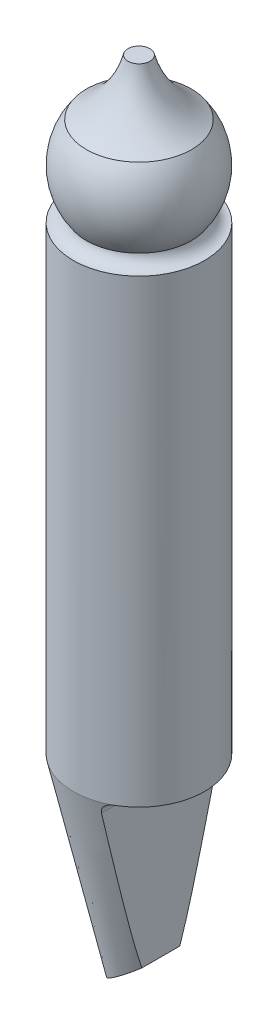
ISO-10303-21;
HEADER;
FILE_DESCRIPTION(('STEP AP214'),'2;1');
FILE_NAME('part.step','',(''),(''),'','','');
FILE_SCHEMA(('AUTOMOTIVE_DESIGN { 1 0 10303 214 1 1 1 1 }'));
ENDSEC;
DATA;
#1=APPLICATION_CONTEXT('core data for automotive mechanical design processes');
#2=APPLICATION_PROTOCOL_DEFINITION('international standard','automotive_design',2000,#1);
#3=PRODUCT_CONTEXT('',#1,'mechanical');
#4=PRODUCT('Part','Part','',(#3));
#5=PRODUCT_RELATED_PRODUCT_CATEGORY('part','',(#4));
#6=PRODUCT_DEFINITION_FORMATION('','',#4);
#7=PRODUCT_DEFINITION_CONTEXT('part definition',#1,'design');
#8=PRODUCT_DEFINITION('design','',#6,#7);
#9=PRODUCT_DEFINITION_SHAPE('','',#8);
#10=(LENGTH_UNIT() NAMED_UNIT(*) SI_UNIT(.MILLI.,.METRE.));
#11=(NAMED_UNIT(*) PLANE_ANGLE_UNIT() SI_UNIT($,.RADIAN.));
#12=(NAMED_UNIT(*) SI_UNIT($,.STERADIAN.) SOLID_ANGLE_UNIT());
#13=UNCERTAINTY_MEASURE_WITH_UNIT(LENGTH_MEASURE(1.E-05),#10,'distance_accuracy_value','');
#14=(GEOMETRIC_REPRESENTATION_CONTEXT(3) GLOBAL_UNCERTAINTY_ASSIGNED_CONTEXT((#13)) GLOBAL_UNIT_ASSIGNED_CONTEXT((#10,
#11,#12)) REPRESENTATION_CONTEXT('',''));
#15=CARTESIAN_POINT('',(0.,0.,0.));
#16=DIRECTION('',(0.,0.,1.));
#17=DIRECTION('',(1.,0.,0.));
#18=AXIS2_PLACEMENT_3D('',#15,#16,#17);
#19=CARTESIAN_POINT('',(0.,9.,0.));
#20=DIRECTION('',(0.,1.,0.));
#21=DIRECTION('',(0.,0.,1.));
#22=AXIS2_PLACEMENT_3D('',#19,#20,#21);
#23=CONICAL_SURFACE('',#22,3.,0.218668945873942);
#24=CARTESIAN_POINT('',(0.,9.,0.));
#25=DIRECTION('',(0.,1.,0.));
#26=DIRECTION('',(0.,0.,1.));
#27=AXIS2_PLACEMENT_3D('',#24,#25,#26);
#28=CIRCLE('',#27,3.);
#29=CARTESIAN_POINT('',(1.50000000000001,9.,-2.59807621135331));
#30=VERTEX_POINT('',#29);
#31=CARTESIAN_POINT('',(1.50000000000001,9.,2.59807621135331));
#32=VERTEX_POINT('',#31);
#33=EDGE_CURVE('E54',#30,#32,#28,.T.);
#34=ORIENTED_EDGE('',*,*,#33,.F.);
#35=CARTESIAN_POINT('',(1.50000000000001,9.,-2.59807621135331));
#36=CARTESIAN_POINT('',(1.47417884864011,9.00002056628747,-2.6130093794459));
#37=CARTESIAN_POINT('',(1.44782787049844,8.99799764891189,-2.62717081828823));
#38=CARTESIAN_POINT('',(1.39471051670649,8.98952744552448,-2.65361666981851));
#39=CARTESIAN_POINT('',(1.36794260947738,8.98305420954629,-2.66588955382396));
#40=CARTESIAN_POINT('',(1.31482468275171,8.96529352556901,-2.68809514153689));
#41=CARTESIAN_POINT('',(1.28847745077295,8.95398196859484,-2.6980157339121));
#42=CARTESIAN_POINT('',(1.23751922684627,8.92654109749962,-2.71506477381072));
#43=CARTESIAN_POINT('',(1.21290336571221,8.91042602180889,-2.72220133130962));
#44=CARTESIAN_POINT('',(1.1691130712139,8.87577185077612,-2.73289924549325));
#45=CARTESIAN_POINT('',(1.14963799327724,8.85770748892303,-2.736771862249));
#46=CARTESIAN_POINT('',(1.11366355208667,8.8185139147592,-2.74220919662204));
#47=CARTESIAN_POINT('',(1.09716451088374,8.79738437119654,-2.74377366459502));
#48=CARTESIAN_POINT('',(1.0686922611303,8.75416608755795,-2.7446806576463));
#49=CARTESIAN_POINT('',(1.05649668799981,8.73222572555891,-2.74415922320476));
#50=CARTESIAN_POINT('',(1.03555351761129,8.68685323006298,-2.74135518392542));
#51=CARTESIAN_POINT('',(1.02680730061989,8.66342050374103,-2.73907187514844));
#52=CARTESIAN_POINT('',(1.01322911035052,8.61670629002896,-2.7330557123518));
#53=CARTESIAN_POINT('',(1.0082499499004,8.59345877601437,-2.72938684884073));
#54=CARTESIAN_POINT('',(1.00162924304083,8.54675811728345,-2.7207632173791));
#55=CARTESIAN_POINT('',(0.999983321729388,8.52330528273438,-2.71581014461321));
#56=CARTESIAN_POINT('',(1.00000000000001,8.5,-2.71029131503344));
#57=B_SPLINE_CURVE_WITH_KNOTS('',3,(#35,#36,#37,#38,#39,#40,#41,#42,#43,#44,#45,#46,#47,#48,#49,
#50,#51,#52,#53,#54,#55,#56),.UNSPECIFIED.,.F.,.F.,(4,2,2,2,2,2,2,2,2,2,4),(0.,
0.089512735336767,0.179551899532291,0.270045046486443,0.360272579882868,0.440378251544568,
0.520492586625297,0.595469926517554,0.670477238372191,0.742376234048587,0.814180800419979),.UNSPECIFIED.);
#58=CARTESIAN_POINT('',(1.00000000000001,8.49999999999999,-2.71029131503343));
#59=VERTEX_POINT('',#58);
#60=EDGE_CURVE('E11',#30,#59,#57,.T.);
#61=ORIENTED_EDGE('',*,*,#60,.T.);
#62=CARTESIAN_POINT('',(1.00000000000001,14.7850191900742,-4.16725604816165));
#63=CARTESIAN_POINT('',(1.00000000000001,14.2111747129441,-4.03609342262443));
#64=CARTESIAN_POINT('',(1.00000000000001,13.6373942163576,-3.90464883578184));
#65=CARTESIAN_POINT('',(1.00000000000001,12.4899407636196,-3.64086626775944));
#66=CARTESIAN_POINT('',(1.00000000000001,11.916267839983,-3.50852814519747));
#67=CARTESIAN_POINT('',(1.00000000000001,10.7726072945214,-3.24346217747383));
#68=CARTESIAN_POINT('',(1.00000000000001,10.2026180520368,-3.11074133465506));
#69=CARTESIAN_POINT('',(1.00000000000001,9.06312541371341,-2.84362112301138));
#70=CARTESIAN_POINT('',(1.00000000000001,8.49362195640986,-2.70922201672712));
#71=CARTESIAN_POINT('',(1.00000000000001,7.41188298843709,-2.45133384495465));
#72=CARTESIAN_POINT('',(1.,6.89958918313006,-2.32809027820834));
#73=CARTESIAN_POINT('',(1.,6.1316494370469,-2.140673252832));
#74=CARTESIAN_POINT('',(1.,5.8756959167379,-2.07776129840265));
#75=CARTESIAN_POINT('',(1.,5.36406832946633,-1.95082823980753));
#76=CARTESIAN_POINT('',(1.,5.10839425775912,-1.88680715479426));
#77=CARTESIAN_POINT('',(1.,4.59575797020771,-1.75686018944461));
#78=CARTESIAN_POINT('',(1.,4.33879820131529,-1.69092462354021));
#79=CARTESIAN_POINT('',(1.,3.8254096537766,-1.55694291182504));
#80=CARTESIAN_POINT('',(1.,3.56898091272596,-1.48889662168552));
#81=CARTESIAN_POINT('',(1.,3.05724705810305,-1.34980417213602));
#82=CARTESIAN_POINT('',(1.,2.80194098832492,-1.27876157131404));
#83=CARTESIAN_POINT('',(1.,2.42007033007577,-1.1684813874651));
#84=CARTESIAN_POINT('',(1.,2.29296946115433,-1.13110440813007));
#85=CARTESIAN_POINT('',(1.,2.03926709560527,-1.05469184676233));
#86=CARTESIAN_POINT('',(1.,1.91266558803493,-1.01565630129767));
#87=CARTESIAN_POINT('',(1.,1.66067231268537,-0.93546020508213));
#88=CARTESIAN_POINT('',(1.,1.53527776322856,-0.894308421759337));
#89=CARTESIAN_POINT('',(1.,1.28532519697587,-0.808654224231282));
#90=CARTESIAN_POINT('',(1.,1.16076944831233,-0.764145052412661));
#91=CARTESIAN_POINT('',(1.,0.975858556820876,-0.693611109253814));
#92=CARTESIAN_POINT('',(1.,0.914752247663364,-0.669561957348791));
#93=CARTESIAN_POINT('',(1.,0.793251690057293,-0.619735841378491));
#94=CARTESIAN_POINT('',(0.999999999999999,0.732857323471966,-0.593959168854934));
#95=CARTESIAN_POINT('',(0.999999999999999,0.613318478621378,-0.540100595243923));
#96=CARTESIAN_POINT('',(0.999999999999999,0.554170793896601,-0.512025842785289));
#97=CARTESIAN_POINT('',(0.999999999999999,0.437647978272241,-0.452440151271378));
#98=CARTESIAN_POINT('',(0.999999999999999,0.380270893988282,-0.420933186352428));
#99=CARTESIAN_POINT('',(0.999999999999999,0.306565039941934,-0.375495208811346));
#100=CARTESIAN_POINT('',(0.999999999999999,0.288700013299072,-0.364075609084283));
#101=CARTESIAN_POINT('',(0.999999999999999,0.253456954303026,-0.34050410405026));
#102=CARTESIAN_POINT('',(0.999999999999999,0.236079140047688,-0.328351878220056));
#103=CARTESIAN_POINT('',(0.999999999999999,0.184977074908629,-0.290663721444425));
#104=CARTESIAN_POINT('',(0.999999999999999,0.152145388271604,-0.263814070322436));
#105=CARTESIAN_POINT('',(0.999999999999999,0.10800731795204,-0.220790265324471));
#106=CARTESIAN_POINT('',(0.999999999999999,0.0946741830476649,-0.206711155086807));
#107=CARTESIAN_POINT('',(0.999999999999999,0.0695986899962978,-0.177154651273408));
#108=CARTESIAN_POINT('',(0.999999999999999,0.0578568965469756,-0.161676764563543));
#109=CARTESIAN_POINT('',(0.999999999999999,0.0385278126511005,-0.131821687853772));
#110=CARTESIAN_POINT('',(0.999999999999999,0.0305745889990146,-0.117685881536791));
#111=CARTESIAN_POINT('',(0.999999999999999,0.0170430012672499,-0.0883207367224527));
#112=CARTESIAN_POINT('',(0.999999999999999,0.0114585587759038,-0.073094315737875));
#113=CARTESIAN_POINT('',(0.999999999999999,0.00421374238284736,-0.0450297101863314));
#114=CARTESIAN_POINT('',(0.999999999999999,0.0019841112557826,-0.0323406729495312));
#115=CARTESIAN_POINT('',(0.999999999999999,-0.000263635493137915,-0.00676761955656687));
#116=CARTESIAN_POINT('',(0.999999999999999,-0.000283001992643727,0.00611628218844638));
#117=CARTESIAN_POINT('',(0.999999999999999,0.0018891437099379,0.0316700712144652));
#118=CARTESIAN_POINT('',(0.999999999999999,0.00407722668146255,0.0443402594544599));
#119=CARTESIAN_POINT('',(0.999999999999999,0.0104087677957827,0.0691797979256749));
#120=CARTESIAN_POINT('',(0.999999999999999,0.0145542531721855,0.0813486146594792));
#121=CARTESIAN_POINT('',(0.999999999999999,0.0270637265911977,0.111314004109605));
#122=CARTESIAN_POINT('',(0.999999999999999,0.0364986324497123,0.128658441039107));
#123=CARTESIAN_POINT('',(0.999999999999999,0.0578693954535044,0.161724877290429));
#124=CARTESIAN_POINT('',(0.999999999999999,0.0698128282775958,0.177441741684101));
#125=CARTESIAN_POINT('',(0.999999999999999,0.0985957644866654,0.211288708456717));
#126=CARTESIAN_POINT('',(0.999999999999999,0.115906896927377,0.229011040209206));
#127=CARTESIAN_POINT('',(0.999999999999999,0.152146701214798,0.262739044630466));
#128=CARTESIAN_POINT('',(0.999999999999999,0.17107849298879,0.278741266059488));
#129=CARTESIAN_POINT('',(0.999999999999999,0.210107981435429,0.309483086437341));
#130=CARTESIAN_POINT('',(0.999999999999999,0.230211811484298,0.324214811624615));
#131=CARTESIAN_POINT('',(0.999999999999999,0.271139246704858,0.352584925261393));
#132=CARTESIAN_POINT('',(0.999999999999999,0.291962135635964,0.366224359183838));
#133=CARTESIAN_POINT('',(0.999999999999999,0.356197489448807,0.40647281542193));
#134=CARTESIAN_POINT('',(0.999999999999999,0.400456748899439,0.431725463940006));
#135=CARTESIAN_POINT('',(0.999999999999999,0.490269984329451,0.479832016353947));
#136=CARTESIAN_POINT('',(0.999999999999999,0.535824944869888,0.502684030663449));
#137=CARTESIAN_POINT('',(0.999999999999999,0.673925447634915,0.568768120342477));
#138=CARTESIAN_POINT('',(0.999999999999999,0.767702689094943,0.609411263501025));
#139=CARTESIAN_POINT('',(1.,0.957005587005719,0.686724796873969));
#140=CARTESIAN_POINT('',(1.,1.0525339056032,0.723388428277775));
#141=CARTESIAN_POINT('',(1.,1.24443780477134,0.793944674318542));
#142=CARTESIAN_POINT('',(1.,1.3408118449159,0.827841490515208));
#143=CARTESIAN_POINT('',(1.,1.53311700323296,0.893343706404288));
#144=CARTESIAN_POINT('',(1.,1.6290408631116,0.924970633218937));
#145=CARTESIAN_POINT('',(1.,1.82134376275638,0.986813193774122));
#146=CARTESIAN_POINT('',(1.,1.91772281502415,1.01702878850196));
#147=CARTESIAN_POINT('',(1.,2.20738405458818,1.10606267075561));
#148=CARTESIAN_POINT('',(1.,2.40116355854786,1.16325916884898));
#149=CARTESIAN_POINT('',(1.,2.78971538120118,1.27492518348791));
#150=CARTESIAN_POINT('',(1.,2.98448852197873,1.32939180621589));
#151=CARTESIAN_POINT('',(1.,3.37455535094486,1.43636198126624));
#152=CARTESIAN_POINT('',(1.,3.56984899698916,1.48886568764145));
#153=CARTESIAN_POINT('',(1.,3.96022624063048,1.59228679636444));
#154=CARTESIAN_POINT('',(1.,4.15530870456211,1.64320849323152));
#155=CARTESIAN_POINT('',(1.,4.5457565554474,1.74396929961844));
#156=CARTESIAN_POINT('',(1.,4.74112194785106,1.7938083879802));
#157=CARTESIAN_POINT('',(1.,5.3273520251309,1.94202599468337));
#158=CARTESIAN_POINT('',(1.,5.71853294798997,2.03915261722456));
#159=CARTESIAN_POINT('',(1.,6.47008309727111,2.22356389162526));
#160=CARTESIAN_POINT('',(1.00000000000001,6.83041194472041,2.31101397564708));
#161=CARTESIAN_POINT('',(1.00000000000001,7.55138646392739,2.48460386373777));
#162=CARTESIAN_POINT('',(1.00000000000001,7.91203213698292,2.57074366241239));
#163=CARTESIAN_POINT('',(1.00000000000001,8.99444649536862,2.82776924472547));
#164=CARTESIAN_POINT('',(1.00000000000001,9.71655374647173,2.99722748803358));
#165=CARTESIAN_POINT('',(1.00000000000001,11.1629440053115,3.33429031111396));
#166=CARTESIAN_POINT('',(1.00000000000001,11.8872282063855,3.50188975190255));
#167=CARTESIAN_POINT('',(1.00000000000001,12.9738298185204,3.75216390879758));
#168=CARTESIAN_POINT('',(1.00000000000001,13.3360198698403,3.83539206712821));
#169=CARTESIAN_POINT('',(1.00000000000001,14.0604702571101,4.00154010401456));
#170=CARTESIAN_POINT('',(1.00000000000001,14.422730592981,4.08445998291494));
#171=CARTESIAN_POINT('',(1.00000000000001,14.7850191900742,4.16725604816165));
#172=B_SPLINE_CURVE_WITH_KNOTS('',3,(#62,#63,#64,#65,#66,#67,#68,#69,#70,#71,#72,#73,#74,#75,
#76,#77,#78,#79,#80,#81,#82,#83,#84,#85,#86,#87,#88,#89,#90,#91,#92,#93,#94,#95,#96,#97,#98,#99,
#100,#101,#102,#103,#104,#105,#106,#107,#108,#109,#110,#111,#112,#113,#114,#115,#116,#117,#118,
#119,#120,#121,#122,#123,#124,#125,#126,#127,#128,#129,#130,#131,#132,#133,#134,#135,#136,#137,
#138,#139,#140,#141,#142,#143,#144,#145,#146,#147,#148,#149,#150,#151,#152,#153,#154,#155,#156,
#157,#158,#159,#160,#161,#162,#163,#164,#165,#166,#167,#168,#169,#170,#171),.UNSPECIFIED.,.F.,
.F.,(4,2,2,2,2,2,2,2,2,2,2,2,2,2,2,2,2,2,2,2,2,2,2,2,2,2,2,2,2,2,2,2,2,2,2,2,2,2,2,2,2,2,2,2,2,
2,2,2,2,2,2,2,2,2,4),(0.,1.76593097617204,3.53214824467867,5.28785796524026,7.04329638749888,
8.62401736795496,9.41473107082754,10.2054311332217,11.001277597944,11.7971786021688,
12.5921595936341,12.9896002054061,13.3870320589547,13.7829325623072,14.1796523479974,
14.3766403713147,14.5735952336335,14.7699591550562,14.9660980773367,15.0296876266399,
15.0933052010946,15.2200571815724,15.2781529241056,15.3362692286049,15.384772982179,
15.4331515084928,15.4716269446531,15.5100806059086,15.5484746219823,15.5869084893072,
15.645799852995,15.7048716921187,15.7790190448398,15.8533124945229,15.9280374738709,
16.0026900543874,16.1554265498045,16.3082823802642,16.6146972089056,16.9216245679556,
17.2280768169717,17.5310737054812,17.8340789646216,18.4401740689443,19.0468986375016,
19.6535754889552,20.2584284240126,20.8632931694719,22.0724572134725,23.1848213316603,
24.297190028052,26.5223558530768,28.7526219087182,29.8675105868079,30.9823980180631),.UNSPECIFIED.);
#173=CARTESIAN_POINT('',(1.,1.45308505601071,-0.866074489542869));
#174=VERTEX_POINT('',#173);
#175=EDGE_CURVE('E70',#59,#174,#172,.T.);
#176=ORIENTED_EDGE('',*,*,#175,.T.);
#177=CARTESIAN_POINT('',(0.192540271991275,0.866431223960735,0.));
#178=DIRECTION('',(0.587785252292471,-0.809016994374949,0.));
#179=DIRECTION('',(0.809016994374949,0.587785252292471,0.));
#180=AXIS2_PLACEMENT_3D('',#177,#178,#179);
#181=ELLIPSE('',#180,1.4740608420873,1.17689444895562);
#182=CARTESIAN_POINT('',(1.,1.45308505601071,0.866074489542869));
#183=VERTEX_POINT('',#182);
#184=EDGE_CURVE('E73',#174,#183,#181,.F.);
#185=ORIENTED_EDGE('',*,*,#184,.T.);
#186=CARTESIAN_POINT('',(1.00000000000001,8.49999999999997,2.71029131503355));
#187=VERTEX_POINT('',#186);
#188=EDGE_CURVE('E80',#183,#187,#172,.T.);
#189=ORIENTED_EDGE('',*,*,#188,.T.);
#190=CARTESIAN_POINT('',(1.00000000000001,8.5,2.71029131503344));
#191=CARTESIAN_POINT('',(0.999973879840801,8.52566932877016,2.71636996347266));
#192=CARTESIAN_POINT('',(1.00197619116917,8.5515228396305,2.721763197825));
#193=CARTESIAN_POINT('',(1.01002228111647,8.60292119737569,2.73097494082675));
#194=CARTESIAN_POINT('',(1.01607274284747,8.62846546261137,2.73479082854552));
#195=CARTESIAN_POINT('',(1.03221668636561,8.67853127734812,2.74062860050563));
#196=CARTESIAN_POINT('',(1.0423186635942,8.7030505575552,2.74264668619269));
#197=CARTESIAN_POINT('',(1.06630896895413,8.75022122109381,2.74465763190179));
#198=CARTESIAN_POINT('',(1.0801927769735,8.77287479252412,2.74465289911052));
#199=CARTESIAN_POINT('',(1.11071414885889,8.8148065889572,2.74249630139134));
#200=CARTESIAN_POINT('',(1.12722546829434,8.83418103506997,2.7404269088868));
#201=CARTESIAN_POINT('',(1.16279493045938,8.87004120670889,2.73418596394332));
#202=CARTESIAN_POINT('',(1.18185342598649,8.88652653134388,2.73001412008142));
#203=CARTESIAN_POINT('',(1.22151686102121,8.91599022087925,2.71967534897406));
#204=CARTESIAN_POINT('',(1.24209158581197,8.92902129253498,2.71354199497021));
#205=CARTESIAN_POINT('',(1.2843880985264,8.95176160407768,2.69937681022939));
#206=CARTESIAN_POINT('',(1.30611026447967,8.96146974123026,2.6913443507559));
#207=CARTESIAN_POINT('',(1.35136780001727,8.97804112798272,2.67304644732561));
#208=CARTESIAN_POINT('',(1.37493445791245,8.98470233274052,2.66267708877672));
#209=CARTESIAN_POINT('',(1.42199711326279,8.994462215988,2.64030641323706));
#210=CARTESIAN_POINT('',(1.44549314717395,8.9975632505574,2.62830618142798));
#211=CARTESIAN_POINT('',(1.47920532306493,8.99967849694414,2.60991741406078));
#212=CARTESIAN_POINT('',(1.48964260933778,9.00000105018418,2.60405755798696));
#213=CARTESIAN_POINT('',(1.50000000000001,9.,2.59807621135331));
#214=B_SPLINE_CURVE_WITH_KNOTS('',3,(#190,#191,#192,#193,#194,#195,#196,#197,#198,#199,#200,
#201,#202,#203,#204,#205,#206,#207,#208,#209,#210,#211,#212,#213),.UNSPECIFIED.,.F.,.F.,(4,2,2,
2,2,2,2,2,2,2,2,4),(0.,0.0790840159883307,0.158298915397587,0.237680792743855,0.316968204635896,
0.393210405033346,0.469463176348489,0.544474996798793,0.619511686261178,0.698983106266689,
0.778401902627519,0.814297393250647),.UNSPECIFIED.);
#215=EDGE_CURVE('E49',#187,#32,#214,.T.);
#216=ORIENTED_EDGE('',*,*,#215,.T.);
#217=EDGE_LOOP('',(#34,#61,#176,#185,#189,#216));
#218=FACE_BOUND('',#217,.T.);
#219=ADVANCED_FACE('F35',(#218),#23,.T.);
#220=CARTESIAN_POINT('',(0.,30.5998930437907,0.));
#221=DIRECTION('',(0.,1.,0.));
#222=DIRECTION('',(0.,0.,1.));
#223=AXIS2_PLACEMENT_3D('',#220,#221,#222);
#224=TOROIDAL_SURFACE('',#223,2.98867145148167,0.6);
#225=CARTESIAN_POINT('',(0.,30.,0.));
#226=DIRECTION('',(0.,1.,0.));
#227=DIRECTION('',(0.,0.,1.));
#228=AXIS2_PLACEMENT_3D('',#225,#226,#227);
#229=CIRCLE('',#228,3.);
#230=CARTESIAN_POINT('',(0.,30.,3.));
#231=VERTEX_POINT('',#230);
#232=EDGE_CURVE('E89',#231,#231,#229,.T.);
#233=ORIENTED_EDGE('',*,*,#232,.T.);
#234=EDGE_LOOP('',(#233));
#235=FACE_BOUND('',#234,.T.);
#236=CARTESIAN_POINT('',(0.,30.4838502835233,0.));
#237=DIRECTION('',(0.,1.,0.));
#238=DIRECTION('',(0.,0.,1.));
#239=AXIS2_PLACEMENT_3D('',#236,#237,#238);
#240=CIRCLE('',#239,2.4);
#241=CARTESIAN_POINT('',(2.4,30.4838502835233,0.));
#242=VERTEX_POINT('',#241);
#243=EDGE_CURVE('E86',#242,#242,#240,.T.);
#244=ORIENTED_EDGE('',*,*,#243,.F.);
#245=EDGE_LOOP('',(#244));
#246=FACE_BOUND('',#245,.T.);
#247=ADVANCED_FACE('F127',(#235,#246),#224,.F.);
#248=CARTESIAN_POINT('',(0.,32.2838502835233,0.));
#249=DIRECTION('',(0.,1.,0.));
#250=DIRECTION('',(1.,0.,0.));
#251=AXIS2_PLACEMENT_3D('',#248,#249,#250);
#252=SPHERICAL_SURFACE('',#251,3.);
#253=CARTESIAN_POINT('',(0.,34.0838502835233,0.));
#254=DIRECTION('',(0.,1.,0.));
#255=DIRECTION('',(0.,0.,1.));
#256=AXIS2_PLACEMENT_3D('',#253,#254,#255);
#257=CIRCLE('',#256,2.4);
#258=CARTESIAN_POINT('',(2.4,34.0838502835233,0.));
#259=VERTEX_POINT('',#258);
#260=EDGE_CURVE('E99',#259,#259,#257,.T.);
#261=CARTESIAN_POINT('',(2.4,34.0838502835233,0.));
#262=CARTESIAN_POINT('',(2.42413167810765,34.0516754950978,0.));
#263=CARTESIAN_POINT('',(2.44761557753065,34.0190149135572,0.));
#264=CARTESIAN_POINT('',(2.49325153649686,33.9527761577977,0.));
#265=CARTESIAN_POINT('',(2.51540359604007,33.9191979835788,0.));
#266=CARTESIAN_POINT('',(2.55833959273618,33.8511780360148,0.));
#267=CARTESIAN_POINT('',(2.57912352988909,33.8167362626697,0.));
#268=CARTESIAN_POINT('',(2.61928978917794,33.7470449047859,0.));
#269=CARTESIAN_POINT('',(2.63867211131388,33.7117953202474,0.));
#270=CARTESIAN_POINT('',(2.67600376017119,33.6405453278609,0.));
#271=CARTESIAN_POINT('',(2.69395308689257,33.6045449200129,0.));
#272=CARTESIAN_POINT('',(2.72838972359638,33.531851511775,0.));
#273=CARTESIAN_POINT('',(2.74487703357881,33.495158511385,0.));
#274=CARTESIAN_POINT('',(2.77636296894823,33.4211392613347,0.));
#275=CARTESIAN_POINT('',(2.79136159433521,33.3838130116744,0.));
#276=CARTESIAN_POINT('',(2.81984590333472,33.3085876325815,0.));
#277=CARTESIAN_POINT('',(2.83333158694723,33.2706885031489,0.));
#278=CARTESIAN_POINT('',(2.85876820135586,33.1943786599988,0.));
#279=CARTESIAN_POINT('',(2.87071913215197,33.1559679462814,0.));
#280=CARTESIAN_POINT('',(2.89306691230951,33.0786970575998,0.));
#281=CARTESIAN_POINT('',(2.90346376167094,33.0398368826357,0.));
#282=CARTESIAN_POINT('',(2.92268656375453,32.9617299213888,0.));
#283=CARTESIAN_POINT('',(2.93151251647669,32.9224831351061,0.));
#284=CARTESIAN_POINT('',(2.94757925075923,32.843666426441,0.));
#285=CARTESIAN_POINT('',(2.9548200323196,32.8040965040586,0.));
#286=CARTESIAN_POINT('',(2.96770471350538,32.7246975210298,0.));
#287=CARTESIAN_POINT('',(2.97334861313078,32.6848684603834,0.));
#288=CARTESIAN_POINT('',(2.98303040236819,32.6050156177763,0.));
#289=CARTESIAN_POINT('',(2.9870682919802,32.5649918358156,0.));
#290=CARTESIAN_POINT('',(2.99353153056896,32.4848142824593,0.));
#291=CARTESIAN_POINT('',(2.99595687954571,32.4446605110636,0.));
#292=CARTESIAN_POINT('',(2.99919111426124,32.364287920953,0.));
#293=CARTESIAN_POINT('',(3.,32.3240691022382,0.));
#294=CARTESIAN_POINT('',(3.,32.2436314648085,0.));
#295=CARTESIAN_POINT('',(2.99919111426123,32.2034126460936,0.));
#296=CARTESIAN_POINT('',(2.99595687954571,32.1230400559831,0.));
#297=CARTESIAN_POINT('',(2.99353153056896,32.0828862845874,0.));
#298=CARTESIAN_POINT('',(2.98706829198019,32.002708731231,0.));
#299=CARTESIAN_POINT('',(2.98303040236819,31.9626849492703,0.));
#300=CARTESIAN_POINT('',(2.97334861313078,31.8828321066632,0.));
#301=CARTESIAN_POINT('',(2.96770471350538,31.8430030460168,0.));
#302=CARTESIAN_POINT('',(2.9548200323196,31.763604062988,0.));
#303=CARTESIAN_POINT('',(2.94757925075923,31.7240341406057,0.));
#304=CARTESIAN_POINT('',(2.93151251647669,31.6452174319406,0.));
#305=CARTESIAN_POINT('',(2.92268656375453,31.6059706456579,0.));
#306=CARTESIAN_POINT('',(2.90346376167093,31.527863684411,0.));
#307=CARTESIAN_POINT('',(2.8930669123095,31.4890035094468,0.));
#308=CARTESIAN_POINT('',(2.87071913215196,31.4117326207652,0.));
#309=CARTESIAN_POINT('',(2.85876820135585,31.3733219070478,0.));
#310=CARTESIAN_POINT('',(2.83333158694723,31.2970120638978,0.));
#311=CARTESIAN_POINT('',(2.81984590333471,31.2591129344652,0.));
#312=CARTESIAN_POINT('',(2.79136159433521,31.1838875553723,0.));
#313=CARTESIAN_POINT('',(2.77636296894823,31.146561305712,0.));
#314=CARTESIAN_POINT('',(2.74487703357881,31.0725420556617,0.));
#315=CARTESIAN_POINT('',(2.72838972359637,31.0358490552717,0.));
#316=CARTESIAN_POINT('',(2.69395308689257,30.9631556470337,0.));
#317=CARTESIAN_POINT('',(2.67600376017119,30.9271552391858,0.));
#318=CARTESIAN_POINT('',(2.63867211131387,30.8559052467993,0.));
#319=CARTESIAN_POINT('',(2.61928978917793,30.8206556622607,0.));
#320=CARTESIAN_POINT('',(2.57912352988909,30.750964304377,0.));
#321=CARTESIAN_POINT('',(2.55833959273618,30.7165225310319,0.));
#322=CARTESIAN_POINT('',(2.51540359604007,30.6485025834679,0.));
#323=CARTESIAN_POINT('',(2.49325153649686,30.614924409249,0.));
#324=CARTESIAN_POINT('',(2.44761557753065,30.5486856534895,0.));
#325=CARTESIAN_POINT('',(2.42413167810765,30.5160250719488,0.));
#326=CARTESIAN_POINT('',(2.4,30.4838502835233,0.));
#327=B_SPLINE_CURVE_WITH_KNOTS('',3,(#261,#262,#263,#264,#265,#266,#267,#268,#269,#270,#271,
#272,#273,#274,#275,#276,#277,#278,#279,#280,#281,#282,#283,#284,#285,#286,#287,#288,#289,#290,
#291,#292,#293,#294,#295,#296,#297,#298,#299,#300,#301,#302,#303,#304,#305,#306,#307,#308,#309,
#310,#311,#312,#313,#314,#315,#316,#317,#318,#319,#320,#321,#322,#323,#324,#325,#326),
.UNSPECIFIED.,.F.,.F.,(4,2,2,2,2,2,2,2,2,2,2,2,2,2,2,2,2,2,2,2,2,2,2,2,2,2,2,2,2,2,2,2,4),(0.,
0.120648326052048,0.241296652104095,0.361944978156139,0.48259330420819,0.603241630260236,
0.723889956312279,0.844538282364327,0.965186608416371,1.08583493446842,1.20648326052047,
1.32713158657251,1.44777991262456,1.56842823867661,1.68907656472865,1.8097248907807,
1.93037321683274,2.05102154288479,2.17166986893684,2.29231819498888,2.41296652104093,
2.53361484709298,2.65426317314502,2.77491149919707,2.89555982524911,3.01620815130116,
3.13685647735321,3.25750480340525,3.3781531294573,3.49880145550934,3.61944978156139,
3.74009810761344,3.86074643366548),.UNSPECIFIED.);
#328=EDGE_CURVE('BSEAM131',#259,#242,#327,.T.);
#329=ORIENTED_EDGE('',*,*,#260,.F.);
#330=ORIENTED_EDGE('',*,*,#243,.T.);
#331=ORIENTED_EDGE('',*,*,#328,.T.);
#332=ORIENTED_EDGE('',*,*,#328,.F.);
#333=EDGE_LOOP('',(#329,#331,#330,#332));
#334=FACE_BOUND('',#333,.T.);
#335=ADVANCED_FACE('F131',(#334),#252,.T.);
#336=CARTESIAN_POINT('',(0.,37.5526362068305,0.));
#337=DIRECTION('',(0.,1.,0.));
#338=DIRECTION('',(0.,0.,1.));
#339=AXIS2_PLACEMENT_3D('',#336,#337,#338);
#340=TOROIDAL_SURFACE('',#339,4.3918645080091,4.);
#341=ORIENTED_EDGE('',*,*,#260,.T.);
#342=EDGE_LOOP('',(#341));
#343=FACE_BOUND('',#342,.T.);
#344=CARTESIAN_POINT('',(0.,36.628844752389,0.));
#345=DIRECTION('',(0.,1.,0.));
#346=DIRECTION('',(0.,0.,1.));
#347=AXIS2_PLACEMENT_3D('',#344,#345,#346);
#348=CIRCLE('',#347,0.5);
#349=CARTESIAN_POINT('',(0.,36.628844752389,0.5));
#350=VERTEX_POINT('',#349);
#351=EDGE_CURVE('E96',#350,#350,#348,.T.);
#352=ORIENTED_EDGE('',*,*,#351,.F.);
#353=EDGE_LOOP('',(#352));
#354=FACE_BOUND('',#353,.T.);
#355=ADVANCED_FACE('F123',(#343,#354),#340,.F.);
#356=CARTESIAN_POINT('',(0.,36.628844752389,0.));
#357=DIRECTION('',(0.,1.,0.));
#358=DIRECTION('',(0.,0.,1.));
#359=AXIS2_PLACEMENT_3D('',#356,#357,#358);
#360=PLANE('',#359);
#361=ORIENTED_EDGE('',*,*,#351,.T.);
#362=EDGE_LOOP('',(#361));
#363=FACE_BOUND('',#362,.T.);
#364=ADVANCED_FACE('F119',(#363),#360,.T.);
#365=CARTESIAN_POINT('',(0.,30.,0.));
#366=DIRECTION('',(0.,1.,0.));
#367=DIRECTION('',(0.,0.,1.));
#368=AXIS2_PLACEMENT_3D('',#365,#366,#367);
#369=CYLINDRICAL_SURFACE('',#368,3.);
#370=ORIENTED_EDGE('',*,*,#33,.T.);
#371=EDGE_CURVE('E94',#32,#30,#28,.T.);
#372=ORIENTED_EDGE('',*,*,#371,.T.);
#373=EDGE_LOOP('',(#370,#372));
#374=FACE_BOUND('',#373,.T.);
#375=ORIENTED_EDGE('',*,*,#232,.F.);
#376=EDGE_LOOP('',(#375));
#377=FACE_BOUND('',#376,.T.);
#378=ADVANCED_FACE('F116',(#374,#377),#369,.T.);
#379=CARTESIAN_POINT('',(0.999999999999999,0.,-3.));
#380=DIRECTION('',(1.,0.,0.));
#381=DIRECTION('',(0.,1.,0.));
#382=AXIS2_PLACEMENT_3D('',#379,#380,#381);
#383=PLANE('',#382);
#384=ORIENTED_EDGE('',*,*,#175,.F.);
#385=DIRECTION('',(0.,0.,1.));
#386=VECTOR('',#385,1.);
#387=CARTESIAN_POINT('',(1.00000000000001,8.5,-3.));
#388=LINE('',#387,#386);
#389=EDGE_CURVE('E79',#59,#187,#388,.T.);
#390=ORIENTED_EDGE('',*,*,#389,.T.);
#391=ORIENTED_EDGE('',*,*,#188,.F.);
#392=DIRECTION('',(0.,0.,1.));
#393=VECTOR('',#392,1.);
#394=CARTESIAN_POINT('',(1.,1.45308505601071,-3.));
#395=LINE('',#394,#393);
#396=EDGE_CURVE('E85',#174,#183,#395,.T.);
#397=ORIENTED_EDGE('',*,*,#396,.F.);
#398=EDGE_LOOP('',(#384,#390,#391,#397));
#399=FACE_BOUND('',#398,.T.);
#400=ADVANCED_FACE('F88',(#399),#383,.T.);
#401=CARTESIAN_POINT('',(0.,9.,-3.));
#402=DIRECTION('',(0.,1.,0.));
#403=DIRECTION('',(0.,0.,1.));
#404=AXIS2_PLACEMENT_3D('',#401,#402,#403);
#405=PLANE('',#404);
#406=ORIENTED_EDGE('',*,*,#371,.F.);
#407=DIRECTION('',(0.,0.,1.));
#408=VECTOR('',#407,1.);
#409=CARTESIAN_POINT('',(1.50000000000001,9.,-3.));
#410=LINE('',#409,#408);
#411=EDGE_CURVE('E199',#32,#30,#410,.F.);
#412=ORIENTED_EDGE('',*,*,#411,.T.);
#413=EDGE_LOOP('',(#406,#412));
#414=FACE_BOUND('',#413,.T.);
#415=ADVANCED_FACE('F115',(#414),#405,.F.);
#416=CARTESIAN_POINT('',(-0.345491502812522,0.475528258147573,-3.));
#417=DIRECTION('',(0.587785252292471,-0.809016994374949,0.));
#418=DIRECTION('',(0.809016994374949,0.587785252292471,0.));
#419=AXIS2_PLACEMENT_3D('',#416,#417,#418);
#420=PLANE('',#419);
#421=ORIENTED_EDGE('',*,*,#396,.T.);
#422=ORIENTED_EDGE('',*,*,#184,.F.);
#423=EDGE_LOOP('',(#421,#422));
#424=FACE_BOUND('',#423,.T.);
#425=ADVANCED_FACE('F84',(#424),#420,.T.);
#426=CARTESIAN_POINT('',(1.50000000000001,8.5,-3.));
#427=DIRECTION('',(0.,0.,1.));
#428=DIRECTION('',(1.,0.,0.));
#429=AXIS2_PLACEMENT_3D('',#426,#427,#428);
#430=CYLINDRICAL_SURFACE('',#429,0.5);
#431=ORIENTED_EDGE('',*,*,#60,.F.);
#432=ORIENTED_EDGE('',*,*,#411,.F.);
#433=ORIENTED_EDGE('',*,*,#215,.F.);
#434=ORIENTED_EDGE('',*,*,#389,.F.);
#435=EDGE_LOOP('',(#431,#432,#433,#434));
#436=FACE_BOUND('',#435,.T.);
#437=ADVANCED_FACE('F37',(#436),#430,.F.);
#438=CLOSED_SHELL('',(#219,#247,#335,#355,#364,#378,#400,#415,#425,#437));
#439=MANIFOLD_SOLID_BREP('B2',#438);
#440=ADVANCED_BREP_SHAPE_REPRESENTATION('',(#18,#439),#14);
#441=SHAPE_DEFINITION_REPRESENTATION(#9,#440);
ENDSEC;
END-ISO-10303-21;
